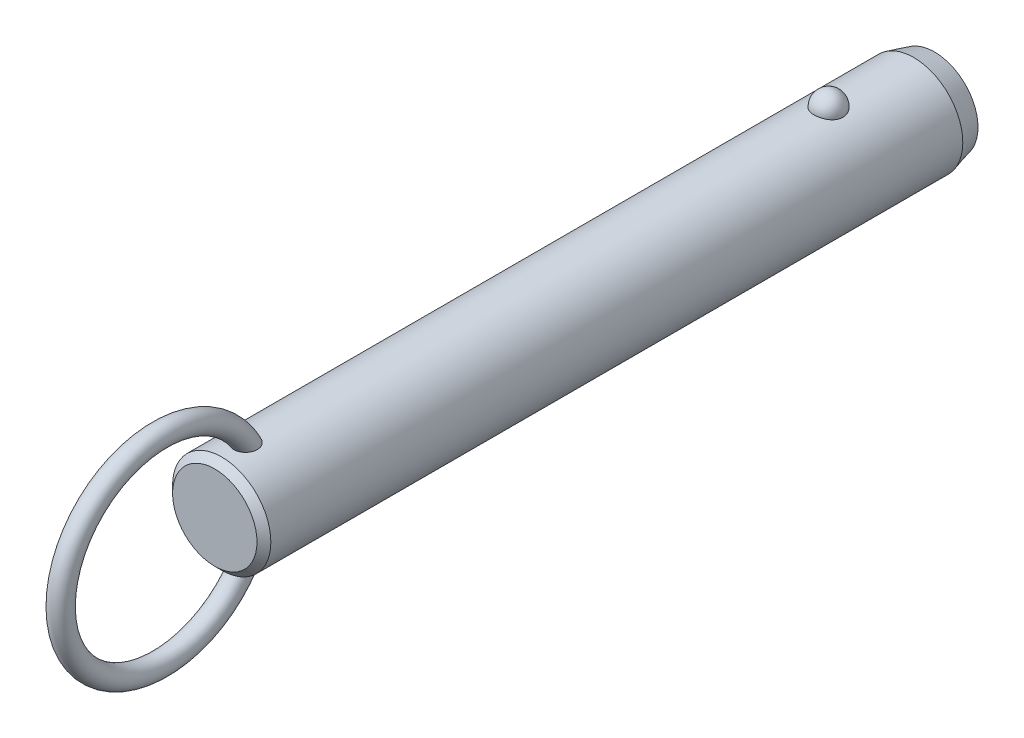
ISO-10303-21;
HEADER;
FILE_DESCRIPTION(('STEP AP214'),'2;1');
FILE_NAME('part.step','',(''),(''),'','','');
FILE_SCHEMA(('AUTOMOTIVE_DESIGN { 1 0 10303 214 1 1 1 1 }'));
ENDSEC;
DATA;
#1=APPLICATION_CONTEXT('core data for automotive mechanical design processes');
#2=APPLICATION_PROTOCOL_DEFINITION('international standard','automotive_design',2000,#1);
#3=PRODUCT_CONTEXT('',#1,'mechanical');
#4=PRODUCT('Part','Part','',(#3));
#5=PRODUCT_RELATED_PRODUCT_CATEGORY('part','',(#4));
#6=PRODUCT_DEFINITION_FORMATION('','',#4);
#7=PRODUCT_DEFINITION_CONTEXT('part definition',#1,'design');
#8=PRODUCT_DEFINITION('design','',#6,#7);
#9=PRODUCT_DEFINITION_SHAPE('','',#8);
#10=(LENGTH_UNIT() NAMED_UNIT(*) SI_UNIT(.MILLI.,.METRE.));
#11=(NAMED_UNIT(*) PLANE_ANGLE_UNIT() SI_UNIT($,.RADIAN.));
#12=(NAMED_UNIT(*) SI_UNIT($,.STERADIAN.) SOLID_ANGLE_UNIT());
#13=UNCERTAINTY_MEASURE_WITH_UNIT(LENGTH_MEASURE(1.E-05),#10,'distance_accuracy_value','');
#14=(GEOMETRIC_REPRESENTATION_CONTEXT(3) GLOBAL_UNCERTAINTY_ASSIGNED_CONTEXT((#13)) GLOBAL_UNIT_ASSIGNED_CONTEXT((#10,
#11,#12)) REPRESENTATION_CONTEXT('',''));
#15=CARTESIAN_POINT('',(0.,0.,0.));
#16=DIRECTION('',(0.,0.,1.));
#17=DIRECTION('',(1.,0.,0.));
#18=AXIS2_PLACEMENT_3D('',#15,#16,#17);
#19=CARTESIAN_POINT('',(0.,0.,78.7));
#20=DIRECTION('',(0.,0.,-1.));
#21=DIRECTION('',(-1.,0.,0.));
#22=AXIS2_PLACEMENT_3D('',#19,#20,#21);
#23=CYLINDRICAL_SURFACE('',#22,7.1);
#24=CARTESIAN_POINT('',(2.0769088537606,6.78943661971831,-2.1));
#25=CARTESIAN_POINT('',(2.07690739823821,6.78943796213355,-1.98268154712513));
#26=CARTESIAN_POINT('',(2.06738130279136,6.79237331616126,-1.86534506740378));
#27=CARTESIAN_POINT('',(2.0295040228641,6.8037853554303,-1.63400788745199));
#28=CARTESIAN_POINT('',(2.00114757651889,6.81226358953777,-1.52000812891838));
#29=CARTESIAN_POINT('',(1.92632025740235,6.83379798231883,-1.29863433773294));
#30=CARTESIAN_POINT('',(1.87985726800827,6.84685214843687,-1.19125744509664));
#31=CARTESIAN_POINT('',(1.76995205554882,6.87608091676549,-0.98604657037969));
#32=CARTESIAN_POINT('',(1.70650980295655,6.8922555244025,-0.88821260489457));
#33=CARTESIAN_POINT('',(1.5638119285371,6.92602930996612,-0.704242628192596));
#34=CARTESIAN_POINT('',(1.4844714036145,6.94363582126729,-0.618173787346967));
#35=CARTESIAN_POINT('',(1.31221746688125,6.97823658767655,-0.460740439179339));
#36=CARTESIAN_POINT('',(1.21930409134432,6.99523084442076,-0.389375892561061));
#37=CARTESIAN_POINT('',(1.02268781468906,7.02666176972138,-0.263547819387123));
#38=CARTESIAN_POINT('',(0.91902009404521,7.04110638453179,-0.209031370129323));
#39=CARTESIAN_POINT('',(0.703548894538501,7.06588726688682,-0.118163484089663));
#40=CARTESIAN_POINT('',(0.591746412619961,7.07622403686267,-0.0818098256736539));
#41=CARTESIAN_POINT('',(0.365557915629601,7.09147068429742,-0.0288711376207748));
#42=CARTESIAN_POINT('',(0.251267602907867,7.09648447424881,-0.0119070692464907));
#43=CARTESIAN_POINT('',(0.0213499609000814,7.10089837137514,0.00304925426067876));
#44=CARTESIAN_POINT('',(-0.0942772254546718,7.10029907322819,0.00104351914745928));
#45=CARTESIAN_POINT('',(-0.321651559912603,7.09360829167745,-0.0216931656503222));
#46=CARTESIAN_POINT('',(-0.433431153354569,7.08760388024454,-0.0421272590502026));
#47=CARTESIAN_POINT('',(-0.651862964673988,7.07086131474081,-0.100729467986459));
#48=CARTESIAN_POINT('',(-0.758515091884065,7.06012307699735,-0.138897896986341));
#49=CARTESIAN_POINT('',(-0.964449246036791,7.03496097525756,-0.232213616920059));
#50=CARTESIAN_POINT('',(-1.06368095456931,7.02051445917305,-0.287465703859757));
#51=CARTESIAN_POINT('',(-1.25145353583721,6.98948740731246,-0.413383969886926));
#52=CARTESIAN_POINT('',(-1.33999321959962,6.97290663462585,-0.48405186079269));
#53=CARTESIAN_POINT('',(-1.50591604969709,6.93898770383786,-0.640594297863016));
#54=CARTESIAN_POINT('',(-1.58302488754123,6.92164094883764,-0.726757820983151));
#55=CARTESIAN_POINT('',(-1.72189320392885,6.8884103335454,-0.91092752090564));
#56=CARTESIAN_POINT('',(-1.78365144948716,6.87252659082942,-1.008934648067));
#57=CARTESIAN_POINT('',(-1.89101272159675,6.84377189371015,-1.21549497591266));
#58=CARTESIAN_POINT('',(-1.93639553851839,6.83094274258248,-1.32416860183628));
#59=CARTESIAN_POINT('',(-2.00874275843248,6.81002070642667,-1.54791500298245));
#60=CARTESIAN_POINT('',(-2.03570774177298,6.80192767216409,-1.66298757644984));
#61=CARTESIAN_POINT('',(-2.07047276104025,6.7914266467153,-1.89571453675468));
#62=CARTESIAN_POINT('',(-2.07835878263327,6.78899315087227,-2.01335491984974));
#63=CARTESIAN_POINT('',(-2.07502083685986,6.79001409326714,-2.24833570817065));
#64=CARTESIAN_POINT('',(-2.06379746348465,6.7934683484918,-2.36567612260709));
#65=CARTESIAN_POINT('',(-2.02263913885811,6.80583442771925,-2.59603194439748));
#66=CARTESIAN_POINT('',(-1.99281127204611,6.81471501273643,-2.70906820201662));
#67=CARTESIAN_POINT('',(-1.91526639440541,6.83691232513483,-2.92836575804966));
#68=CARTESIAN_POINT('',(-1.8675486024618,6.85022924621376,-3.03462676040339));
#69=CARTESIAN_POINT('',(-1.75504492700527,6.87991336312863,-3.23806487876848));
#70=CARTESIAN_POINT('',(-1.69015924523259,6.89629822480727,-3.33518422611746));
#71=CARTESIAN_POINT('',(-1.54505404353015,6.93024852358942,-3.51697105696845));
#72=CARTESIAN_POINT('',(-1.46483385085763,6.94781401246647,-3.60163799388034));
#73=CARTESIAN_POINT('',(-1.29071406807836,6.98225977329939,-3.75654119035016));
#74=CARTESIAN_POINT('',(-1.19675650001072,6.99913673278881,-3.82671308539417));
#75=CARTESIAN_POINT('',(-0.997940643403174,7.03023618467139,-3.9501837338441));
#76=CARTESIAN_POINT('',(-0.89308318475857,7.04445887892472,-4.00348377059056));
#77=CARTESIAN_POINT('',(-0.676902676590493,7.06848365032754,-4.09107242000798));
#78=CARTESIAN_POINT('',(-0.565686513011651,7.0783430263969,-4.12560889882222));
#79=CARTESIAN_POINT('',(-0.338739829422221,7.09282534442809,-4.17575450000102));
#80=CARTESIAN_POINT('',(-0.223009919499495,7.09744899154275,-4.19136617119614));
#81=CARTESIAN_POINT('',(0.00707628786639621,7.10090930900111,-4.20307965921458));
#82=CARTESIAN_POINT('',(0.121410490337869,7.09986531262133,-4.19958377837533));
#83=CARTESIAN_POINT('',(0.347815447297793,7.092380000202,-4.17411564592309));
#84=CARTESIAN_POINT('',(0.459886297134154,7.08593891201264,-4.15214417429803));
#85=CARTESIAN_POINT('',(0.678084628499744,7.06838983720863,-4.09049562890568));
#86=CARTESIAN_POINT('',(0.784237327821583,7.05730369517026,-4.05090137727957));
#87=CARTESIAN_POINT('',(0.988305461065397,7.03163139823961,-3.95511447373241));
#88=CARTESIAN_POINT('',(1.08622031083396,7.01704499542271,-3.89892064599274));
#89=CARTESIAN_POINT('',(1.27284490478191,6.98562668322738,-3.77035541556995));
#90=CARTESIAN_POINT('',(1.36137372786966,6.96876135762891,-3.69772964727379));
#91=CARTESIAN_POINT('',(1.52509486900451,6.93477412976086,-3.53878279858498));
#92=CARTESIAN_POINT('',(1.60028496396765,6.91765218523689,-3.45245943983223));
#93=CARTESIAN_POINT('',(1.73681688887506,6.88465753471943,-3.26658774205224));
#94=CARTESIAN_POINT('',(1.79785966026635,6.86881574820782,-3.16681408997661));
#95=CARTESIAN_POINT('',(1.90265327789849,6.84053157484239,-2.95814408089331));
#96=CARTESIAN_POINT('',(1.94640861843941,6.82808830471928,-2.84925010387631));
#97=CARTESIAN_POINT('',(2.01274378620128,6.80881460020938,-2.63454318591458));
#98=CARTESIAN_POINT('',(2.03676193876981,6.80160856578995,-2.52920574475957));
#99=CARTESIAN_POINT('',(2.06884490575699,6.79191902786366,-2.3159172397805));
#100=CARTESIAN_POINT('',(2.07691019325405,6.78943538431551,-2.20796625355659));
#101=CARTESIAN_POINT('',(2.0769088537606,6.78943661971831,-2.1));
#102=B_SPLINE_CURVE_WITH_KNOTS('',3,(#24,#25,#26,#27,#28,#29,#30,#31,#32,#33,#34,#35,#36,#37,
#38,#39,#40,#41,#42,#43,#44,#45,#46,#47,#48,#49,#50,#51,#52,#53,#54,#55,#56,#57,#58,#59,#60,#61,
#62,#63,#64,#65,#66,#67,#68,#69,#70,#71,#72,#73,#74,#75,#76,#77,#78,#79,#80,#81,#82,#83,#84,#85,
#86,#87,#88,#89,#90,#91,#92,#93,#94,#95,#96,#97,#98,#99,#100,#101),.UNSPECIFIED.,.T.,.F.,(4,2,2,
2,2,2,2,2,2,2,2,2,2,2,2,2,2,2,2,2,2,2,2,2,2,2,2,2,2,2,2,2,2,2,2,2,2,2,4),(0.,0.351568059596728,
0.703234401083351,1.05474780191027,1.40626181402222,1.75970563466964,2.11314851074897,
2.4654696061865,2.81774759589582,3.16301449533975,3.50824481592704,3.84801136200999,
4.18778391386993,4.52968352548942,4.87162112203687,5.22076181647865,5.56993054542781,
5.92363364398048,6.27732559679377,6.62942052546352,6.98150450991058,7.33158042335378,
7.68167162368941,8.03384443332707,8.38603269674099,8.73975272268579,9.09344583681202,
9.44234545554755,9.79119807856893,10.1327344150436,10.4742563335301,10.8141898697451,
11.1541474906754,11.4997793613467,11.8454687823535,12.1979079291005,12.5502553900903,
12.8738073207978,13.1973496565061),.UNSPECIFIED.);
#103=CARTESIAN_POINT('',(2.0769088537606,6.78943661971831,-2.1));
#104=VERTEX_POINT('',#103);
#105=EDGE_CURVE('E41',#104,#104,#102,.T.);
#106=ORIENTED_EDGE('',*,*,#105,.T.);
#107=EDGE_LOOP('',(#106));
#108=FACE_BOUND('',#107,.T.);
#109=CARTESIAN_POINT('',(0.,0.,85.62));
#110=DIRECTION('',(0.,0.,1.));
#111=DIRECTION('',(1.,0.,0.));
#112=AXIS2_PLACEMENT_3D('',#109,#110,#111);
#113=CIRCLE('',#112,7.1);
#114=CARTESIAN_POINT('',(7.1,0.,85.62));
#115=VERTEX_POINT('',#114);
#116=EDGE_CURVE('E10',#115,#115,#113,.F.);
#117=ORIENTED_EDGE('',*,*,#116,.T.);
#118=EDGE_LOOP('',(#117));
#119=FACE_BOUND('',#118,.T.);
#120=CARTESIAN_POINT('',(-0.429539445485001,-7.08699541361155,80.4429212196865));
#121=CARTESIAN_POINT('',(-0.508331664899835,-7.08221999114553,80.4668764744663));
#122=CARTESIAN_POINT('',(-0.585039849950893,-7.07624016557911,80.4974570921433));
#123=CARTESIAN_POINT('',(-0.732082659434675,-7.06254296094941,80.5710242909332));
#124=CARTESIAN_POINT('',(-0.802417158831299,-7.05482554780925,80.6140111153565));
#125=CARTESIAN_POINT('',(-0.934722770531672,-7.03851844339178,80.7111135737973));
#126=CARTESIAN_POINT('',(-0.996700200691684,-7.02992941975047,80.7652207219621));
#127=CARTESIAN_POINT('',(-1.11079942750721,-7.01280697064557,80.8829676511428));
#128=CARTESIAN_POINT('',(-1.16292136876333,-7.00427354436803,80.9466072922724));
#129=CARTESIAN_POINT('',(-1.25705660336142,-6.98799959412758,81.0826870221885));
#130=CARTESIAN_POINT('',(-1.29888032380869,-6.98027525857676,81.1552598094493));
#131=CARTESIAN_POINT('',(-1.37069920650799,-6.96652886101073,81.3061686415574));
#132=CARTESIAN_POINT('',(-1.40069157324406,-6.96050720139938,81.3845060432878));
#133=CARTESIAN_POINT('',(-1.45043507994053,-6.95031881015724,81.5501903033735));
#134=CARTESIAN_POINT('',(-1.46937115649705,-6.94630231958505,81.6377897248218));
#135=CARTESIAN_POINT('',(-1.49424917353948,-6.94099239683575,81.8148714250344));
#136=CARTESIAN_POINT('',(-1.50018601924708,-6.93970003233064,81.9043544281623));
#137=CARTESIAN_POINT('',(-1.49978214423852,-6.93978815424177,82.0940607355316));
#138=CARTESIAN_POINT('',(-1.49187639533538,-6.94150934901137,82.194279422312));
#139=CARTESIAN_POINT('',(-1.46177925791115,-6.94790814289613,82.3924798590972));
#140=CARTESIAN_POINT('',(-1.43957541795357,-6.95258831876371,82.490459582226));
#141=CARTESIAN_POINT('',(-1.37783293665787,-6.96510647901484,82.6953629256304));
#142=CARTESIAN_POINT('',(-1.33634073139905,-6.97328848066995,82.8016801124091));
#143=CARTESIAN_POINT('',(-1.23686994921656,-6.99161706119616,83.0061777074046));
#144=CARTESIAN_POINT('',(-1.17889192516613,-7.00176357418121,83.1043583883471));
#145=CARTESIAN_POINT('',(-1.0587512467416,-7.02082898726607,83.2723743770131));
#146=CARTESIAN_POINT('',(-0.999247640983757,-7.02963746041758,83.3441230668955));
#147=CARTESIAN_POINT('',(-0.869494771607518,-7.04686074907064,83.4771959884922));
#148=CARTESIAN_POINT('',(-0.79926347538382,-7.05527619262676,83.5385372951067));
#149=CARTESIAN_POINT('',(-0.665408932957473,-7.06899457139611,83.6351316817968));
#150=CARTESIAN_POINT('',(-0.603817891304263,-7.07457275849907,83.6731512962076));
#151=CARTESIAN_POINT('',(-0.475172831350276,-7.08437420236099,83.7387581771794));
#152=CARTESIAN_POINT('',(-0.408123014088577,-7.08859848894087,83.7663533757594));
#153=CARTESIAN_POINT('',(-0.269431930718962,-7.09522749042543,83.8092569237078));
#154=CARTESIAN_POINT('',(-0.197757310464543,-7.09761688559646,83.8244618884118));
#155=CARTESIAN_POINT('',(-0.0527849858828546,-7.10017268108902,83.8407168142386));
#156=CARTESIAN_POINT('',(0.0205115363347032,-7.10034065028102,83.8417767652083));
#157=CARTESIAN_POINT('',(0.156426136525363,-7.09855986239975,83.8304619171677));
#158=CARTESIAN_POINT('',(0.219199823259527,-7.09688191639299,83.8198060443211));
#159=CARTESIAN_POINT('',(0.342134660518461,-7.09201880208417,83.7885379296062));
#160=CARTESIAN_POINT('',(0.402295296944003,-7.08883333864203,83.7679237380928));
#161=CARTESIAN_POINT('',(0.52068738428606,-7.08113868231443,83.7172125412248));
#162=CARTESIAN_POINT('',(0.578791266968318,-7.07658958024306,83.6868272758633));
#163=CARTESIAN_POINT('',(0.690173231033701,-7.06659708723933,83.6183678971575));
#164=CARTESIAN_POINT('',(0.743447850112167,-7.061153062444,83.5802883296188));
#165=CARTESIAN_POINT('',(0.870947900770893,-7.04680292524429,83.4765929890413));
#166=CARTESIAN_POINT('',(0.941828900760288,-7.0375580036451,83.4068972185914));
#167=CARTESIAN_POINT('',(1.07136606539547,-7.01900793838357,83.2569450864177));
#168=CARTESIAN_POINT('',(1.13000013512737,-7.00970271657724,83.1766700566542));
#169=CARTESIAN_POINT('',(1.23579584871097,-6.99183327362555,83.0068997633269));
#170=CARTESIAN_POINT('',(1.28274271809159,-6.98328455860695,82.9172696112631));
#171=CARTESIAN_POINT('',(1.36351442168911,-6.96796352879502,82.7321763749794));
#172=CARTESIAN_POINT('',(1.39733971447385,-6.96119115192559,82.6367134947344));
#173=CARTESIAN_POINT('',(1.45579181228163,-6.94922464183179,82.4253092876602));
#174=CARTESIAN_POINT('',(1.47790145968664,-6.94449000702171,82.308631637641));
#175=CARTESIAN_POINT('',(1.50168752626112,-6.93938731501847,82.0730153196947));
#176=CARTESIAN_POINT('',(1.50336085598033,-6.93901991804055,81.9540763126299));
#177=CARTESIAN_POINT('',(1.48486516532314,-6.9430010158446,81.7236079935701));
#178=CARTESIAN_POINT('',(1.46573441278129,-6.9471253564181,81.6119958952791));
#179=CARTESIAN_POINT('',(1.40606892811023,-6.95944667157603,81.3948868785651));
#180=CARTESIAN_POINT('',(1.3655644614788,-6.96763788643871,81.2893815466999));
#181=CARTESIAN_POINT('',(1.27082700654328,-6.98548038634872,81.1042879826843));
#182=CARTESIAN_POINT('',(1.21949810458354,-6.99473841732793,81.0231719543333));
#183=CARTESIAN_POINT('',(1.10242050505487,-7.01414069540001,80.8722278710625));
#184=CARTESIAN_POINT('',(1.03668119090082,-7.02428436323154,80.8023925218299));
#185=CARTESIAN_POINT('',(0.900559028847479,-7.04295285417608,80.6835735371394));
#186=CARTESIAN_POINT('',(0.831428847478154,-7.05153466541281,80.6331573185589));
#187=CARTESIAN_POINT('',(0.685291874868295,-7.06723150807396,80.5451429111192));
#188=CARTESIAN_POINT('',(0.608287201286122,-7.0743469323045,80.5075412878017));
#189=CARTESIAN_POINT('',(0.451878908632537,-7.08602232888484,80.4474915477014));
#190=CARTESIAN_POINT('',(0.372686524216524,-7.09067127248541,80.4245088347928));
#191=CARTESIAN_POINT('',(0.211477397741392,-7.09730788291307,80.3920357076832));
#192=CARTESIAN_POINT('',(0.129460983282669,-7.09929585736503,80.3825437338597));
#193=CARTESIAN_POINT('',(-0.0332905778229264,-7.10037858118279,80.3773517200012));
#194=CARTESIAN_POINT('',(-0.114016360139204,-7.09953334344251,80.3813656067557));
#195=CARTESIAN_POINT('',(-0.273670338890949,-7.09517338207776,80.4024540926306));
#196=CARTESIAN_POINT('',(-0.352598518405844,-7.09165863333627,80.4195288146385));
#197=CARTESIAN_POINT('',(-0.429539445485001,-7.08699541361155,80.4429212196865));
#198=B_SPLINE_CURVE_WITH_KNOTS('',3,(#120,#121,#122,#123,#124,#125,#126,#127,#128,#129,#130,
#131,#132,#133,#134,#135,#136,#137,#138,#139,#140,#141,#142,#143,#144,#145,#146,#147,#148,#149,
#150,#151,#152,#153,#154,#155,#156,#157,#158,#159,#160,#161,#162,#163,#164,#165,#166,#167,#168,
#169,#170,#171,#172,#173,#174,#175,#176,#177,#178,#179,#180,#181,#182,#183,#184,#185,#186,#187,
#188,#189,#190,#191,#192,#193,#194,#195,#196,#197),.UNSPECIFIED.,.T.,.F.,(4,2,2,2,2,2,2,2,2,2,2,
2,2,2,2,2,2,2,2,2,2,2,2,2,2,2,2,2,2,2,2,2,2,2,2,2,2,2,4),(0.,0.247183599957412,0.49437204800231,
0.741372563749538,0.988369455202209,1.23962059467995,1.49093106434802,1.75897818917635,
2.02713035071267,2.32758265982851,2.62829697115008,2.97008736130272,3.31186629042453,
3.59175319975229,3.87117637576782,4.08813841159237,4.30493502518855,4.52352259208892,
4.74195577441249,4.93215328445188,5.12238804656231,5.31884850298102,5.51544871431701,
5.81332317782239,6.11173048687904,6.41527266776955,6.71880423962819,7.07358156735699,
7.42841252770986,7.76631485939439,8.10373999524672,8.39142246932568,8.67891817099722,
8.93560332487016,9.19221962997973,9.43881106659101,9.68537399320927,9.92674752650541,
10.1681233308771),.UNSPECIFIED.);
#199=CARTESIAN_POINT('',(-0.429539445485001,-7.08699541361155,80.4429212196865));
#200=VERTEX_POINT('',#199);
#201=EDGE_CURVE('E59',#200,#200,#198,.T.);
#202=ORIENTED_EDGE('',*,*,#201,.T.);
#203=EDGE_LOOP('',(#202));
#204=FACE_BOUND('',#203,.T.);
#205=CARTESIAN_POINT('',(-0.429539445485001,7.08699541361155,80.4429212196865));
#206=CARTESIAN_POINT('',(-0.351665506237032,7.09171429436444,80.4192469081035));
#207=CARTESIAN_POINT('',(-0.271733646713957,7.09525896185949,80.4020369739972));
#208=CARTESIAN_POINT('',(-0.110026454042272,7.09960839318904,80.3810059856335));
#209=CARTESIAN_POINT('',(-0.0282502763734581,7.10041187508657,80.377191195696));
#210=CARTESIAN_POINT('',(0.134782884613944,7.09918849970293,80.383059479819));
#211=CARTESIAN_POINT('',(0.216039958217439,7.09716214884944,80.3927401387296));
#212=CARTESIAN_POINT('',(0.375730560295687,7.09050177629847,80.4253471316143));
#213=CARTESIAN_POINT('',(0.454164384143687,7.08586802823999,80.4482720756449));
#214=CARTESIAN_POINT('',(0.60602533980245,7.07449911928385,80.5067718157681));
#215=CARTESIAN_POINT('',(0.679451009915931,7.06776334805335,80.5423502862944));
#216=CARTESIAN_POINT('',(0.819234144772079,7.05292866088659,80.6251753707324));
#217=CARTESIAN_POINT('',(0.88559181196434,7.04482978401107,80.6724216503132));
#218=CARTESIAN_POINT('',(1.00993211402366,7.02808709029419,80.7775902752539));
#219=CARTESIAN_POINT('',(1.06785399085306,7.01943990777,80.835583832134));
#220=CARTESIAN_POINT('',(1.17342527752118,7.00256662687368,80.9603013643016));
#221=CARTESIAN_POINT('',(1.22107408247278,6.99434055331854,81.0270258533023));
#222=CARTESIAN_POINT('',(1.30652927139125,6.97889183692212,81.1693622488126));
#223=CARTESIAN_POINT('',(1.34399711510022,6.97170674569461,81.2451808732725));
#224=CARTESIAN_POINT('',(1.40682616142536,6.95930080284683,81.4018100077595));
#225=CARTESIAN_POINT('',(1.43218374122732,6.95408053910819,81.4826220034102));
#226=CARTESIAN_POINT('',(1.47246409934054,6.94566853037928,81.6535314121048));
#227=CARTESIAN_POINT('',(1.48642590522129,6.9426653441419,81.7438630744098));
#228=CARTESIAN_POINT('',(1.5011410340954,6.93949744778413,81.925619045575));
#229=CARTESIAN_POINT('',(1.50188917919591,6.93933385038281,82.0170437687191));
#230=CARTESIAN_POINT('',(1.49030464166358,6.94183245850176,82.2108438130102));
#231=CARTESIAN_POINT('',(1.47627413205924,6.94486147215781,82.313112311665));
#232=CARTESIAN_POINT('',(1.43356351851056,6.95380194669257,82.5144719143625));
#233=CARTESIAN_POINT('',(1.4048676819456,6.95971650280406,82.6135594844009));
#234=CARTESIAN_POINT('',(1.32908750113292,6.97461208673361,82.8189087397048));
#235=CARTESIAN_POINT('',(1.28011435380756,6.98388945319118,82.9244566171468));
#236=CARTESIAN_POINT('',(1.16520357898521,7.00397743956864,83.1257604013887));
#237=CARTESIAN_POINT('',(1.09927694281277,7.01478706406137,83.2215225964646));
#238=CARTESIAN_POINT('',(0.969361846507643,7.03373936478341,83.3767565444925));
#239=CARTESIAN_POINT('',(0.909042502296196,7.04187023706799,83.4393032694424));
#240=CARTESIAN_POINT('',(0.779178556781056,7.05741732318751,83.5540535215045));
#241=CARTESIAN_POINT('',(0.709649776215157,7.06483472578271,83.6062744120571));
#242=CARTESIAN_POINT('',(0.576854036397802,7.0767751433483,83.6881138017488));
#243=CARTESIAN_POINT('',(0.515118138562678,7.08158033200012,83.7201641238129));
#244=CARTESIAN_POINT('',(0.387127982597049,7.08972701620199,83.7737656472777));
#245=CARTESIAN_POINT('',(0.320877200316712,7.09306962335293,83.7953248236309));
#246=CARTESIAN_POINT('',(0.185041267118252,7.09791507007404,83.8264005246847));
#247=CARTESIAN_POINT('',(0.115437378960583,7.09940591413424,83.8358385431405));
#248=CARTESIAN_POINT('',(-0.0243157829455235,7.10030171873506,83.8415226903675));
#249=CARTESIAN_POINT('',(-0.0944648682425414,7.0997073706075,83.8377731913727));
#250=CARTESIAN_POINT('',(-0.225713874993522,7.09668414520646,83.8185081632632));
#251=CARTESIAN_POINT('',(-0.28700675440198,7.09444865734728,83.8042323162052));
#252=CARTESIAN_POINT('',(-0.406555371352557,7.08860360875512,83.7663685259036));
#253=CARTESIAN_POINT('',(-0.464809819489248,7.08499346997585,83.7427766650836));
#254=CARTESIAN_POINT('',(-0.594955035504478,7.07541654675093,83.6789232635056));
#255=CARTESIAN_POINT('',(-0.665389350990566,7.06906574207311,83.635753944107));
#256=CARTESIAN_POINT('',(-0.798242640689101,7.05530261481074,83.538587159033));
#257=CARTESIAN_POINT('',(-0.860645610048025,7.0478882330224,83.4845686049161));
#258=CARTESIAN_POINT('',(-0.994249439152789,7.03045217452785,83.3509965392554));
#259=CARTESIAN_POINT('',(-1.06260129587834,7.02030745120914,83.2686143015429));
#260=CARTESIAN_POINT('',(-1.18502045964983,7.00068382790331,83.093843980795));
#261=CARTESIAN_POINT('',(-1.23907684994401,6.99120544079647,83.001448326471));
#262=CARTESIAN_POINT('',(-1.33335589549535,6.97384343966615,82.8080085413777));
#263=CARTESIAN_POINT('',(-1.3733613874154,6.96598557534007,82.7068564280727));
#264=CARTESIAN_POINT('',(-1.43770677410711,6.9529905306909,82.4995046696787));
#265=CARTESIAN_POINT('',(-1.46204473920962,6.94785368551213,82.39330440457));
#266=CARTESIAN_POINT('',(-1.49537533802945,6.94076296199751,82.1682317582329));
#267=CARTESIAN_POINT('',(-1.50273564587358,6.93914842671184,82.0490975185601));
#268=CARTESIAN_POINT('',(-1.4954555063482,6.94072368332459,81.8114703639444));
#269=CARTESIAN_POINT('',(-1.48082914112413,6.94391040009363,81.6929770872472));
#270=CARTESIAN_POINT('',(-1.43076401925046,6.95438579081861,81.4734325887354));
#271=CARTESIAN_POINT('',(-1.39762227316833,6.96121852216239,81.3718413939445));
#272=CARTESIAN_POINT('',(-1.31211274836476,6.97783941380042,81.1773513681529));
#273=CARTESIAN_POINT('',(-1.2597660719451,6.98762432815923,81.0844431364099));
#274=CARTESIAN_POINT('',(-1.14583073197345,7.00713153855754,80.9241601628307));
#275=CARTESIAN_POINT('',(-1.08665947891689,7.01665982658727,80.8550351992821));
#276=CARTESIAN_POINT('',(-0.956606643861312,7.03556646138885,80.7288786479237));
#277=CARTESIAN_POINT('',(-0.885737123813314,7.04494495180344,80.6718347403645));
#278=CARTESIAN_POINT('',(-0.751558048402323,7.06035735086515,80.5831004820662));
#279=CARTESIAN_POINT('',(-0.690120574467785,7.0666695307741,80.5485932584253));
#280=CARTESIAN_POINT('',(-0.562815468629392,7.07794609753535,80.4887507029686));
#281=CARTESIAN_POINT('',(-0.496948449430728,7.08291067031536,80.4634141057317));
#282=CARTESIAN_POINT('',(-0.429539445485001,7.08699541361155,80.4429212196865));
#283=B_SPLINE_CURVE_WITH_KNOTS('',3,(#205,#206,#207,#208,#209,#210,#211,#212,#213,#214,#215,
#216,#217,#218,#219,#220,#221,#222,#223,#224,#225,#226,#227,#228,#229,#230,#231,#232,#233,#234,
#235,#236,#237,#238,#239,#240,#241,#242,#243,#244,#245,#246,#247,#248,#249,#250,#251,#252,#253,
#254,#255,#256,#257,#258,#259,#260,#261,#262,#263,#264,#265,#266,#267,#268,#269,#270,#271,#272,
#273,#274,#275,#276,#277,#278,#279,#280,#281,#282),.UNSPECIFIED.,.T.,.F.,(4,2,2,2,2,2,2,2,2,2,2,
2,2,2,2,2,2,2,2,2,2,2,2,2,2,2,2,2,2,2,2,2,2,2,2,2,2,2,4),(0.,0.244335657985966,
0.488785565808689,0.733191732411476,0.977572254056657,1.22202379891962,1.46646834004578,
1.71259457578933,1.95873529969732,2.21226768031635,2.46587585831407,2.7391381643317,
3.01250754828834,3.32109936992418,3.63002293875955,3.9786351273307,4.32702187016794,
4.58793945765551,4.84841449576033,5.05676704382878,5.26496096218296,5.47449661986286,
5.68396281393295,5.8720544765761,6.06022532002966,6.30743751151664,6.55513496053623,
6.87602468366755,7.19715875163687,7.52305774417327,7.84899686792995,8.20516155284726,
8.56109821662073,8.8804008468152,9.19935367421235,9.47236282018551,9.74509220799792,
9.9566225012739,10.1681235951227),.UNSPECIFIED.);
#284=CARTESIAN_POINT('',(-0.429539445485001,7.08699541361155,80.4429212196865));
#285=VERTEX_POINT('',#284);
#286=EDGE_CURVE('E66',#285,#285,#283,.T.);
#287=ORIENTED_EDGE('',*,*,#286,.T.);
#288=EDGE_LOOP('',(#287));
#289=FACE_BOUND('',#288,.T.);
#290=CARTESIAN_POINT('',(0.,0.,-14.3999999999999));
#291=DIRECTION('',(0.,0.,-1.));
#292=DIRECTION('',(-1.,0.,0.));
#293=AXIS2_PLACEMENT_3D('',#290,#291,#292);
#294=CIRCLE('',#293,7.1);
#295=CARTESIAN_POINT('',(7.1,0.,-14.3999999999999));
#296=VERTEX_POINT('',#295);
#297=EDGE_CURVE('E56',#296,#296,#294,.F.);
#298=ORIENTED_EDGE('',*,*,#297,.T.);
#299=EDGE_LOOP('',(#298));
#300=FACE_BOUND('',#299,.T.);
#301=ADVANCED_FACE('F37',(#108,#119,#204,#289,#300),#23,.T.);
#302=CARTESIAN_POINT('',(0.,0.,-17.4));
#303=DIRECTION('',(0.,0.,-1.));
#304=DIRECTION('',(-1.,0.,0.));
#305=AXIS2_PLACEMENT_3D('',#302,#303,#304);
#306=PLANE('',#305);
#307=CARTESIAN_POINT('',(0.,0.,-17.4));
#308=DIRECTION('',(0.,0.,-1.));
#309=DIRECTION('',(-1.,0.,0.));
#310=AXIS2_PLACEMENT_3D('',#307,#308,#309);
#311=CIRCLE('',#310,6.29615242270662);
#312=CARTESIAN_POINT('',(6.29615242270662,0.,-17.4));
#313=VERTEX_POINT('',#312);
#314=EDGE_CURVE('E65',#313,#313,#311,.T.);
#315=ORIENTED_EDGE('',*,*,#314,.T.);
#316=EDGE_LOOP('',(#315));
#317=FACE_BOUND('',#316,.T.);
#318=ADVANCED_FACE('F84',(#317),#306,.T.);
#319=CARTESIAN_POINT('',(0.,0.,-17.4));
#320=DIRECTION('',(0.,0.,1.));
#321=DIRECTION('',(1.,0.,0.));
#322=AXIS2_PLACEMENT_3D('',#319,#320,#321);
#323=CONICAL_SURFACE('',#322,6.29615242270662,0.261799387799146);
#324=CARTESIAN_POINT('',(7.1,0.,-14.3999999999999));
#325=CARTESIAN_POINT('',(7.09162658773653,0.,-14.4312499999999));
#326=CARTESIAN_POINT('',(7.08325317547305,0.,-14.4624999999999));
#327=CARTESIAN_POINT('',(7.06650635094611,0.,-14.5249999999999));
#328=CARTESIAN_POINT('',(7.05813293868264,0.,-14.5562499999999));
#329=CARTESIAN_POINT('',(7.04138611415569,0.,-14.6187499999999));
#330=CARTESIAN_POINT('',(7.03301270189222,0.,-14.6499999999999));
#331=CARTESIAN_POINT('',(7.01626587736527,0.,-14.7124999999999));
#332=CARTESIAN_POINT('',(7.0078924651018,0.,-14.7437499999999));
#333=CARTESIAN_POINT('',(6.99114564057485,0.,-14.8062499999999));
#334=CARTESIAN_POINT('',(6.98277222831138,0.,-14.8374999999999));
#335=CARTESIAN_POINT('',(6.96602540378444,0.,-14.8999999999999));
#336=CARTESIAN_POINT('',(6.95765199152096,0.,-14.9312499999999));
#337=CARTESIAN_POINT('',(6.94090516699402,0.,-14.9937499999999));
#338=CARTESIAN_POINT('',(6.93253175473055,0.,-15.0249999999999));
#339=CARTESIAN_POINT('',(6.9157849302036,0.,-15.0874999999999));
#340=CARTESIAN_POINT('',(6.90741151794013,0.,-15.1187499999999));
#341=CARTESIAN_POINT('',(6.89066469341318,0.,-15.1812499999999));
#342=CARTESIAN_POINT('',(6.88229128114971,0.,-15.2124999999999));
#343=CARTESIAN_POINT('',(6.86554445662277,0.,-15.2749999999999));
#344=CARTESIAN_POINT('',(6.85717104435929,0.,-15.3062499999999));
#345=CARTESIAN_POINT('',(6.84042421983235,0.,-15.3687499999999));
#346=CARTESIAN_POINT('',(6.83205080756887,0.,-15.4));
#347=CARTESIAN_POINT('',(6.81530398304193,0.,-15.4625));
#348=CARTESIAN_POINT('',(6.80693057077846,0.,-15.49375));
#349=CARTESIAN_POINT('',(6.79018374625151,0.,-15.55625));
#350=CARTESIAN_POINT('',(6.78181033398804,0.,-15.5875));
#351=CARTESIAN_POINT('',(6.76506350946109,0.,-15.65));
#352=CARTESIAN_POINT('',(6.75669009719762,0.,-15.68125));
#353=CARTESIAN_POINT('',(6.73994327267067,0.,-15.74375));
#354=CARTESIAN_POINT('',(6.7315698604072,0.,-15.775));
#355=CARTESIAN_POINT('',(6.71482303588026,0.,-15.8375));
#356=CARTESIAN_POINT('',(6.70644962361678,0.,-15.86875));
#357=CARTESIAN_POINT('',(6.68970279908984,0.,-15.93125));
#358=CARTESIAN_POINT('',(6.68132938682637,0.,-15.9625));
#359=CARTESIAN_POINT('',(6.66458256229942,0.,-16.025));
#360=CARTESIAN_POINT('',(6.65620915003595,0.,-16.05625));
#361=CARTESIAN_POINT('',(6.639462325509,0.,-16.11875));
#362=CARTESIAN_POINT('',(6.63108891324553,0.,-16.15));
#363=CARTESIAN_POINT('',(6.61434208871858,0.,-16.2125));
#364=CARTESIAN_POINT('',(6.60596867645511,0.,-16.24375));
#365=CARTESIAN_POINT('',(6.58922185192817,0.,-16.30625));
#366=CARTESIAN_POINT('',(6.58084843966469,0.,-16.3375));
#367=CARTESIAN_POINT('',(6.56410161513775,0.,-16.4));
#368=CARTESIAN_POINT('',(6.55572820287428,0.,-16.43125));
#369=CARTESIAN_POINT('',(6.53898137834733,0.,-16.49375));
#370=CARTESIAN_POINT('',(6.53060796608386,0.,-16.525));
#371=CARTESIAN_POINT('',(6.51386114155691,0.,-16.5875));
#372=CARTESIAN_POINT('',(6.50548772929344,0.,-16.61875));
#373=CARTESIAN_POINT('',(6.4887409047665,0.,-16.68125));
#374=CARTESIAN_POINT('',(6.48036749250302,0.,-16.7125));
#375=CARTESIAN_POINT('',(6.46362066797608,0.,-16.775));
#376=CARTESIAN_POINT('',(6.4552472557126,0.,-16.80625));
#377=CARTESIAN_POINT('',(6.43850043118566,0.,-16.86875));
#378=CARTESIAN_POINT('',(6.43012701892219,0.,-16.9));
#379=CARTESIAN_POINT('',(6.41338019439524,0.,-16.9625));
#380=CARTESIAN_POINT('',(6.40500678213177,0.,-16.99375));
#381=CARTESIAN_POINT('',(6.38825995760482,0.,-17.05625));
#382=CARTESIAN_POINT('',(6.37988654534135,0.,-17.0875));
#383=CARTESIAN_POINT('',(6.3631397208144,0.,-17.15));
#384=CARTESIAN_POINT('',(6.35476630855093,0.,-17.18125));
#385=CARTESIAN_POINT('',(6.33801948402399,0.,-17.24375));
#386=CARTESIAN_POINT('',(6.32964607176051,0.,-17.275));
#387=CARTESIAN_POINT('',(6.31289924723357,0.,-17.3375));
#388=CARTESIAN_POINT('',(6.3045258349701,0.,-17.36875));
#389=CARTESIAN_POINT('',(6.29615242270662,0.,-17.4));
#390=B_SPLINE_CURVE_WITH_KNOTS('',3,(#324,#325,#326,#327,#328,#329,#330,#331,#332,#333,#334,
#335,#336,#337,#338,#339,#340,#341,#342,#343,#344,#345,#346,#347,#348,#349,#350,#351,#352,#353,
#354,#355,#356,#357,#358,#359,#360,#361,#362,#363,#364,#365,#366,#367,#368,#369,#370,#371,#372,
#373,#374,#375,#376,#377,#378,#379,#380,#381,#382,#383,#384,#385,#386,#387,#388,#389),
.UNSPECIFIED.,.F.,.F.,(4,2,2,2,2,2,2,2,2,2,2,2,2,2,2,2,2,2,2,2,2,2,2,2,2,2,2,2,2,2,2,2,4),(0.,
0.0970571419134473,0.194114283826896,0.291171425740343,0.38822856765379,0.485285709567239,
0.582342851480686,0.679399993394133,0.776457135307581,0.873514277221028,0.970571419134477,
1.06762856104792,1.16468570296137,1.26174284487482,1.35879998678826,1.45585712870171,
1.55291427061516,1.64997141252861,1.74702855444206,1.8440856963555,1.94114283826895,
2.0381999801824,2.13525712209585,2.23231426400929,2.32937140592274,2.42642854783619,
2.52348568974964,2.62054283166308,2.71759997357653,2.81465711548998,2.91171425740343,
3.00877139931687,3.10582854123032),.UNSPECIFIED.);
#391=EDGE_CURVE('BSEAM82',#296,#313,#390,.T.);
#392=ORIENTED_EDGE('',*,*,#297,.F.);
#393=ORIENTED_EDGE('',*,*,#314,.F.);
#394=ORIENTED_EDGE('',*,*,#391,.T.);
#395=ORIENTED_EDGE('',*,*,#391,.F.);
#396=EDGE_LOOP('',(#392,#394,#393,#395));
#397=FACE_BOUND('',#396,.T.);
#398=ADVANCED_FACE('F82',(#397),#323,.T.);
#399=CARTESIAN_POINT('',(0.,0.,86.62));
#400=DIRECTION('',(0.,0.,1.));
#401=DIRECTION('',(1.,0.,0.));
#402=AXIS2_PLACEMENT_3D('',#399,#400,#401);
#403=PLANE('',#402);
#404=CARTESIAN_POINT('',(0.,0.,86.62));
#405=DIRECTION('',(0.,0.,1.));
#406=DIRECTION('',(1.,0.,0.));
#407=AXIS2_PLACEMENT_3D('',#404,#405,#406);
#408=CIRCLE('',#407,6.09999999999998);
#409=CARTESIAN_POINT('',(6.09999999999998,0.,86.62));
#410=VERTEX_POINT('',#409);
#411=EDGE_CURVE('E50',#410,#410,#408,.T.);
#412=ORIENTED_EDGE('',*,*,#411,.T.);
#413=EDGE_LOOP('',(#412));
#414=FACE_BOUND('',#413,.T.);
#415=ADVANCED_FACE('F76',(#414),#403,.T.);
#416=CARTESIAN_POINT('',(0.,0.,94.55));
#417=DIRECTION('',(1.,0.,0.));
#418=DIRECTION('',(0.,0.,-1.));
#419=AXIS2_PLACEMENT_3D('',#416,#417,#418);
#420=TOROIDAL_SURFACE('',#419,14.35,1.5);
#421=ORIENTED_EDGE('',*,*,#286,.F.);
#422=EDGE_LOOP('',(#421));
#423=FACE_BOUND('',#422,.T.);
#424=ORIENTED_EDGE('',*,*,#201,.F.);
#425=EDGE_LOOP('',(#424));
#426=FACE_BOUND('',#425,.T.);
#427=ADVANCED_FACE('F72',(#423,#426),#420,.T.);
#428=CARTESIAN_POINT('',(0.,0.,86.62));
#429=DIRECTION('',(0.,0.,-1.));
#430=DIRECTION('',(-1.,0.,0.));
#431=AXIS2_PLACEMENT_3D('',#428,#429,#430);
#432=CONICAL_SURFACE('',#431,6.09999999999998,0.785398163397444);
#433=ORIENTED_EDGE('',*,*,#116,.F.);
#434=EDGE_LOOP('',(#433));
#435=FACE_BOUND('',#434,.T.);
#436=ORIENTED_EDGE('',*,*,#411,.F.);
#437=EDGE_LOOP('',(#436));
#438=FACE_BOUND('',#437,.T.);
#439=ADVANCED_FACE('F39',(#435,#438),#432,.T.);
#440=CARTESIAN_POINT('',(0.,7.1,-2.1));
#441=DIRECTION('',(0.,1.,0.));
#442=DIRECTION('',(0.,0.,1.));
#443=AXIS2_PLACEMENT_3D('',#440,#441,#442);
#444=SPHERICAL_SURFACE('',#443,2.10000000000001);
#445=ORIENTED_EDGE('',*,*,#105,.F.);
#446=EDGE_LOOP('',(#445));
#447=FACE_BOUND('',#446,.T.);
#448=ADVANCED_FACE('F78',(#447),#444,.T.);
#449=CLOSED_SHELL('',(#301,#318,#398,#415,#427,#439,#448));
#450=MANIFOLD_SOLID_BREP('B2',#449);
#451=ADVANCED_BREP_SHAPE_REPRESENTATION('',(#18,#450),#14);
#452=SHAPE_DEFINITION_REPRESENTATION(#9,#451);
ENDSEC;
END-ISO-10303-21;
